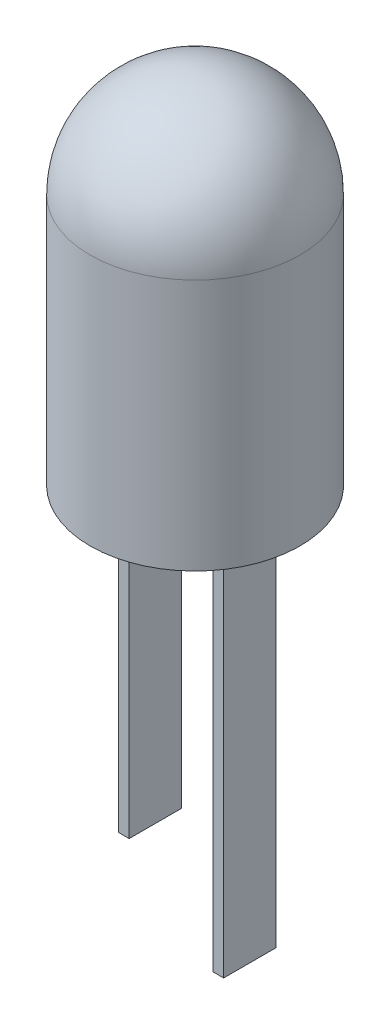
ISO-10303-21;
HEADER;
FILE_DESCRIPTION(('STEP AP214'),'2;1');
FILE_NAME('part.step','',(''),(''),'','','');
FILE_SCHEMA(('AUTOMOTIVE_DESIGN { 1 0 10303 214 1 1 1 1 }'));
ENDSEC;
DATA;
#1=APPLICATION_CONTEXT('core data for automotive mechanical design processes');
#2=APPLICATION_PROTOCOL_DEFINITION('international standard','automotive_design',2000,#1);
#3=PRODUCT_CONTEXT('',#1,'mechanical');
#4=PRODUCT('Part','Part','',(#3));
#5=PRODUCT_RELATED_PRODUCT_CATEGORY('part','',(#4));
#6=PRODUCT_DEFINITION_FORMATION('','',#4);
#7=PRODUCT_DEFINITION_CONTEXT('part definition',#1,'design');
#8=PRODUCT_DEFINITION('design','',#6,#7);
#9=PRODUCT_DEFINITION_SHAPE('','',#8);
#10=(LENGTH_UNIT() NAMED_UNIT(*) SI_UNIT(.MILLI.,.METRE.));
#11=(NAMED_UNIT(*) PLANE_ANGLE_UNIT() SI_UNIT($,.RADIAN.));
#12=(NAMED_UNIT(*) SI_UNIT($,.STERADIAN.) SOLID_ANGLE_UNIT());
#13=UNCERTAINTY_MEASURE_WITH_UNIT(LENGTH_MEASURE(1.E-05),#10,'distance_accuracy_value','');
#14=(GEOMETRIC_REPRESENTATION_CONTEXT(3) GLOBAL_UNCERTAINTY_ASSIGNED_CONTEXT((#13)) GLOBAL_UNIT_ASSIGNED_CONTEXT((#10,
#11,#12)) REPRESENTATION_CONTEXT('',''));
#15=CARTESIAN_POINT('',(0.,0.,0.));
#16=DIRECTION('',(0.,0.,1.));
#17=DIRECTION('',(1.,0.,0.));
#18=AXIS2_PLACEMENT_3D('',#15,#16,#17);
#19=CARTESIAN_POINT('',(0.,24.,0.));
#20=DIRECTION('',(0.,-1.,0.));
#21=DIRECTION('',(0.,0.,-1.));
#22=AXIS2_PLACEMENT_3D('',#19,#20,#21);
#23=CYLINDRICAL_SURFACE('',#22,9.99999999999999);
#24=CARTESIAN_POINT('',(0.,24.,0.));
#25=DIRECTION('',(0.,1.,0.));
#26=DIRECTION('',(0.,0.,1.));
#27=AXIS2_PLACEMENT_3D('',#24,#25,#26);
#28=CIRCLE('',#27,9.99999999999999);
#29=CARTESIAN_POINT('',(0.,24.,9.99999999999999));
#30=VERTEX_POINT('',#29);
#31=EDGE_CURVE('E11',#30,#30,#28,.T.);
#32=ORIENTED_EDGE('',*,*,#31,.F.);
#33=EDGE_LOOP('',(#32));
#34=FACE_BOUND('',#33,.T.);
#35=CARTESIAN_POINT('',(0.,0.,0.));
#36=DIRECTION('',(0.,1.,0.));
#37=DIRECTION('',(0.,0.,1.));
#38=AXIS2_PLACEMENT_3D('',#35,#36,#37);
#39=CIRCLE('',#38,9.99999999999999);
#40=CARTESIAN_POINT('',(0.,0.,9.99999999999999));
#41=VERTEX_POINT('',#40);
#42=EDGE_CURVE('E43',#41,#41,#39,.T.);
#43=ORIENTED_EDGE('',*,*,#42,.T.);
#44=EDGE_LOOP('',(#43));
#45=FACE_BOUND('',#44,.T.);
#46=ADVANCED_FACE('F35',(#34,#45),#23,.T.);
#47=CARTESIAN_POINT('',(0.,24.,0.));
#48=DIRECTION('',(0.,0.,1.));
#49=DIRECTION('',(1.,0.,0.));
#50=AXIS2_PLACEMENT_3D('',#47,#48,#49);
#51=SPHERICAL_SURFACE('',#50,9.99999999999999);
#52=CARTESIAN_POINT('',(0.,24.,0.));
#53=DIRECTION('',(0.,1.,0.));
#54=DIRECTION('',(0.,0.,1.));
#55=AXIS2_PLACEMENT_3D('',#52,#53,#54);
#56=SPHERICAL_SURFACE('',#55,9.99999999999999);
#57=ORIENTED_EDGE('',*,*,#31,.T.);
#58=EDGE_LOOP('',(#57));
#59=FACE_BOUND('',#58,.T.);
#60=ADVANCED_FACE('F37',(#59),#56,.T.);
#61=CARTESIAN_POINT('',(0.,0.,0.));
#62=DIRECTION('',(0.,1.,0.));
#63=DIRECTION('',(0.,0.,1.));
#64=AXIS2_PLACEMENT_3D('',#61,#62,#63);
#65=PLANE('',#64);
#66=DIRECTION('',(1.,0.,0.));
#67=VECTOR('',#66,1.);
#68=CARTESIAN_POINT('',(0.,0.,-2.72300379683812));
#69=LINE('',#68,#67);
#70=CARTESIAN_POINT('',(4.,0.,-2.72300379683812));
#71=VERTEX_POINT('',#70);
#72=CARTESIAN_POINT('',(5.,0.,-2.72300379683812));
#73=VERTEX_POINT('',#72);
#74=EDGE_CURVE('E136',#71,#73,#69,.T.);
#75=ORIENTED_EDGE('',*,*,#74,.F.);
#76=DIRECTION('',(0.,0.,1.));
#77=VECTOR('',#76,1.);
#78=CARTESIAN_POINT('',(4.,0.,-22.1414213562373));
#79=LINE('',#78,#77);
#80=CARTESIAN_POINT('',(4.,0.,2.27699620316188));
#81=VERTEX_POINT('',#80);
#82=EDGE_CURVE('E111',#71,#81,#79,.T.);
#83=ORIENTED_EDGE('',*,*,#82,.T.);
#84=DIRECTION('',(1.,0.,0.));
#85=VECTOR('',#84,1.);
#86=CARTESIAN_POINT('',(0.,0.,2.27699620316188));
#87=LINE('',#86,#85);
#88=CARTESIAN_POINT('',(5.,0.,2.27699620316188));
#89=VERTEX_POINT('',#88);
#90=EDGE_CURVE('E127',#81,#89,#87,.T.);
#91=ORIENTED_EDGE('',*,*,#90,.T.);
#92=DIRECTION('',(0.,0.,1.));
#93=VECTOR('',#92,1.);
#94=CARTESIAN_POINT('',(5.,0.,-22.1414213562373));
#95=LINE('',#94,#93);
#96=EDGE_CURVE('E50',#73,#89,#95,.T.);
#97=ORIENTED_EDGE('',*,*,#96,.F.);
#98=EDGE_LOOP('',(#75,#83,#91,#97));
#99=FACE_BOUND('',#98,.T.);
#100=DIRECTION('',(0.,0.,-1.));
#101=VECTOR('',#100,1.);
#102=CARTESIAN_POINT('',(-5.,0.,2.27699620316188));
#103=LINE('',#102,#101);
#104=CARTESIAN_POINT('',(-5.,0.,2.27699620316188));
#105=VERTEX_POINT('',#104);
#106=CARTESIAN_POINT('',(-5.,0.,-2.72300379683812));
#107=VERTEX_POINT('',#106);
#108=EDGE_CURVE('E147',#105,#107,#103,.T.);
#109=ORIENTED_EDGE('',*,*,#108,.F.);
#110=DIRECTION('',(1.,0.,0.));
#111=VECTOR('',#110,1.);
#112=CARTESIAN_POINT('',(-5.,0.,2.27699620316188));
#113=LINE('',#112,#111);
#114=CARTESIAN_POINT('',(-4.,0.,2.27699620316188));
#115=VERTEX_POINT('',#114);
#116=EDGE_CURVE('E114',#105,#115,#113,.T.);
#117=ORIENTED_EDGE('',*,*,#116,.T.);
#118=DIRECTION('',(0.,0.,-1.));
#119=VECTOR('',#118,1.);
#120=CARTESIAN_POINT('',(-4.,0.,2.27699620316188));
#121=LINE('',#120,#119);
#122=CARTESIAN_POINT('',(-4.,0.,-2.72300379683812));
#123=VERTEX_POINT('',#122);
#124=EDGE_CURVE('E157',#115,#123,#121,.T.);
#125=ORIENTED_EDGE('',*,*,#124,.T.);
#126=DIRECTION('',(1.,0.,0.));
#127=VECTOR('',#126,1.);
#128=CARTESIAN_POINT('',(-5.,0.,-2.72300379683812));
#129=LINE('',#128,#127);
#130=EDGE_CURVE('E58',#107,#123,#129,.T.);
#131=ORIENTED_EDGE('',*,*,#130,.F.);
#132=EDGE_LOOP('',(#109,#117,#125,#131));
#133=FACE_BOUND('',#132,.T.);
#134=ORIENTED_EDGE('',*,*,#42,.F.);
#135=EDGE_LOOP('',(#134));
#136=FACE_BOUND('',#135,.T.);
#137=ADVANCED_FACE('F172',(#99,#133,#136),#65,.F.);
#138=CARTESIAN_POINT('',(-5.,-30.,2.27699620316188));
#139=DIRECTION('',(0.,0.,1.));
#140=DIRECTION('',(1.,0.,0.));
#141=AXIS2_PLACEMENT_3D('',#138,#139,#140);
#142=PLANE('',#141);
#143=ORIENTED_EDGE('',*,*,#116,.F.);
#144=DIRECTION('',(0.,1.,0.));
#145=VECTOR('',#144,1.);
#146=CARTESIAN_POINT('',(-5.,-30.,2.27699620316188));
#147=LINE('',#146,#145);
#148=CARTESIAN_POINT('',(-5.,-30.,2.27699620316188));
#149=VERTEX_POINT('',#148);
#150=EDGE_CURVE('E162',#149,#105,#147,.T.);
#151=ORIENTED_EDGE('',*,*,#150,.F.);
#152=DIRECTION('',(1.,0.,0.));
#153=VECTOR('',#152,1.);
#154=CARTESIAN_POINT('',(-5.,-30.,2.27699620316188));
#155=LINE('',#154,#153);
#156=CARTESIAN_POINT('',(-4.,-30.,2.27699620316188));
#157=VERTEX_POINT('',#156);
#158=EDGE_CURVE('E143',#149,#157,#155,.T.);
#159=ORIENTED_EDGE('',*,*,#158,.T.);
#160=DIRECTION('',(0.,1.,0.));
#161=VECTOR('',#160,1.);
#162=CARTESIAN_POINT('',(-4.,-30.,2.27699620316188));
#163=LINE('',#162,#161);
#164=EDGE_CURVE('E154',#157,#115,#163,.T.);
#165=ORIENTED_EDGE('',*,*,#164,.T.);
#166=EDGE_LOOP('',(#143,#151,#159,#165));
#167=FACE_BOUND('',#166,.T.);
#168=ADVANCED_FACE('F174',(#167),#142,.T.);
#169=CARTESIAN_POINT('',(-5.,-30.,2.27699620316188));
#170=DIRECTION('',(1.,0.,0.));
#171=DIRECTION('',(0.,0.,-1.));
#172=AXIS2_PLACEMENT_3D('',#169,#170,#171);
#173=PLANE('',#172);
#174=ORIENTED_EDGE('',*,*,#108,.T.);
#175=DIRECTION('',(0.,1.,0.));
#176=VECTOR('',#175,1.);
#177=CARTESIAN_POINT('',(-5.,-30.,-2.72300379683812));
#178=LINE('',#177,#176);
#179=CARTESIAN_POINT('',(-5.,-30.,-2.72300379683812));
#180=VERTEX_POINT('',#179);
#181=EDGE_CURVE('E164',#180,#107,#178,.T.);
#182=ORIENTED_EDGE('',*,*,#181,.F.);
#183=DIRECTION('',(0.,0.,-1.));
#184=VECTOR('',#183,1.);
#185=CARTESIAN_POINT('',(-5.,-30.,2.27699620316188));
#186=LINE('',#185,#184);
#187=EDGE_CURVE('E152',#149,#180,#186,.T.);
#188=ORIENTED_EDGE('',*,*,#187,.F.);
#189=ORIENTED_EDGE('',*,*,#150,.T.);
#190=EDGE_LOOP('',(#174,#182,#188,#189));
#191=FACE_BOUND('',#190,.T.);
#192=ADVANCED_FACE('F181',(#191),#173,.F.);
#193=CARTESIAN_POINT('',(-5.,-30.,-2.72300379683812));
#194=DIRECTION('',(0.,0.,1.));
#195=DIRECTION('',(1.,0.,0.));
#196=AXIS2_PLACEMENT_3D('',#193,#194,#195);
#197=PLANE('',#196);
#198=ORIENTED_EDGE('',*,*,#130,.T.);
#199=DIRECTION('',(0.,1.,0.));
#200=VECTOR('',#199,1.);
#201=CARTESIAN_POINT('',(-4.,-30.,-2.72300379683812));
#202=LINE('',#201,#200);
#203=CARTESIAN_POINT('',(-4.,-30.,-2.72300379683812));
#204=VERTEX_POINT('',#203);
#205=EDGE_CURVE('E166',#204,#123,#202,.T.);
#206=ORIENTED_EDGE('',*,*,#205,.F.);
#207=DIRECTION('',(1.,0.,0.));
#208=VECTOR('',#207,1.);
#209=CARTESIAN_POINT('',(-5.,-30.,-2.72300379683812));
#210=LINE('',#209,#208);
#211=EDGE_CURVE('E150',#180,#204,#210,.T.);
#212=ORIENTED_EDGE('',*,*,#211,.F.);
#213=ORIENTED_EDGE('',*,*,#181,.T.);
#214=EDGE_LOOP('',(#198,#206,#212,#213));
#215=FACE_BOUND('',#214,.T.);
#216=ADVANCED_FACE('F211',(#215),#197,.F.);
#217=CARTESIAN_POINT('',(-4.,-30.,2.27699620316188));
#218=DIRECTION('',(1.,0.,0.));
#219=DIRECTION('',(0.,0.,-1.));
#220=AXIS2_PLACEMENT_3D('',#217,#218,#219);
#221=PLANE('',#220);
#222=ORIENTED_EDGE('',*,*,#124,.F.);
#223=ORIENTED_EDGE('',*,*,#164,.F.);
#224=DIRECTION('',(0.,0.,-1.));
#225=VECTOR('',#224,1.);
#226=CARTESIAN_POINT('',(-4.,-30.,2.27699620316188));
#227=LINE('',#226,#225);
#228=EDGE_CURVE('E146',#157,#204,#227,.T.);
#229=ORIENTED_EDGE('',*,*,#228,.T.);
#230=ORIENTED_EDGE('',*,*,#205,.T.);
#231=EDGE_LOOP('',(#222,#223,#229,#230));
#232=FACE_BOUND('',#231,.T.);
#233=ADVANCED_FACE('F221',(#232),#221,.T.);
#234=CARTESIAN_POINT('',(-4.,-30.,2.27699620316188));
#235=DIRECTION('',(0.,1.,0.));
#236=DIRECTION('',(0.,0.,1.));
#237=AXIS2_PLACEMENT_3D('',#234,#235,#236);
#238=PLANE('',#237);
#239=ORIENTED_EDGE('',*,*,#158,.F.);
#240=ORIENTED_EDGE('',*,*,#187,.T.);
#241=ORIENTED_EDGE('',*,*,#211,.T.);
#242=ORIENTED_EDGE('',*,*,#228,.F.);
#243=EDGE_LOOP('',(#239,#240,#241,#242));
#244=FACE_BOUND('',#243,.T.);
#245=ADVANCED_FACE('F230',(#244),#238,.F.);
#246=CARTESIAN_POINT('',(4.,-37.,-22.1414213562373));
#247=DIRECTION('',(-1.,0.,0.));
#248=DIRECTION('',(0.,0.,1.));
#249=AXIS2_PLACEMENT_3D('',#246,#247,#248);
#250=PLANE('',#249);
#251=ORIENTED_EDGE('',*,*,#82,.F.);
#252=DIRECTION('',(0.,1.,0.));
#253=VECTOR('',#252,1.);
#254=CARTESIAN_POINT('',(4.,-37.,-2.72300379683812));
#255=LINE('',#254,#253);
#256=CARTESIAN_POINT('',(4.,-37.,-2.72300379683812));
#257=VERTEX_POINT('',#256);
#258=EDGE_CURVE('E104',#257,#71,#255,.T.);
#259=ORIENTED_EDGE('',*,*,#258,.F.);
#260=DIRECTION('',(0.,0.,1.));
#261=VECTOR('',#260,1.);
#262=CARTESIAN_POINT('',(4.,-37.,-22.1414213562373));
#263=LINE('',#262,#261);
#264=CARTESIAN_POINT('',(4.,-37.,2.27699620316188));
#265=VERTEX_POINT('',#264);
#266=EDGE_CURVE('E108',#257,#265,#263,.T.);
#267=ORIENTED_EDGE('',*,*,#266,.T.);
#268=DIRECTION('',(0.,1.,0.));
#269=VECTOR('',#268,1.);
#270=CARTESIAN_POINT('',(4.,-37.,2.27699620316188));
#271=LINE('',#270,#269);
#272=EDGE_CURVE('E134',#265,#81,#271,.T.);
#273=ORIENTED_EDGE('',*,*,#272,.T.);
#274=EDGE_LOOP('',(#251,#259,#267,#273));
#275=FACE_BOUND('',#274,.T.);
#276=ADVANCED_FACE('F106',(#275),#250,.T.);
#277=CARTESIAN_POINT('',(0.,-37.,-2.72300379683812));
#278=DIRECTION('',(0.,0.,1.));
#279=DIRECTION('',(1.,0.,0.));
#280=AXIS2_PLACEMENT_3D('',#277,#278,#279);
#281=PLANE('',#280);
#282=ORIENTED_EDGE('',*,*,#74,.T.);
#283=DIRECTION('',(0.,1.,0.));
#284=VECTOR('',#283,1.);
#285=CARTESIAN_POINT('',(5.,-37.,-2.72300379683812));
#286=LINE('',#285,#284);
#287=CARTESIAN_POINT('',(5.,-37.,-2.72300379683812));
#288=VERTEX_POINT('',#287);
#289=EDGE_CURVE('E115',#288,#73,#286,.T.);
#290=ORIENTED_EDGE('',*,*,#289,.F.);
#291=DIRECTION('',(1.,0.,0.));
#292=VECTOR('',#291,1.);
#293=CARTESIAN_POINT('',(0.,-37.,-2.72300379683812));
#294=LINE('',#293,#292);
#295=EDGE_CURVE('E118',#257,#288,#294,.T.);
#296=ORIENTED_EDGE('',*,*,#295,.F.);
#297=ORIENTED_EDGE('',*,*,#258,.T.);
#298=EDGE_LOOP('',(#282,#290,#296,#297));
#299=FACE_BOUND('',#298,.T.);
#300=ADVANCED_FACE('F119',(#299),#281,.F.);
#301=CARTESIAN_POINT('',(5.,-37.,-22.1414213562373));
#302=DIRECTION('',(-1.,0.,0.));
#303=DIRECTION('',(0.,0.,1.));
#304=AXIS2_PLACEMENT_3D('',#301,#302,#303);
#305=PLANE('',#304);
#306=ORIENTED_EDGE('',*,*,#96,.T.);
#307=DIRECTION('',(0.,1.,0.));
#308=VECTOR('',#307,1.);
#309=CARTESIAN_POINT('',(5.,-37.,2.27699620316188));
#310=LINE('',#309,#308);
#311=CARTESIAN_POINT('',(5.,-37.,2.27699620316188));
#312=VERTEX_POINT('',#311);
#313=EDGE_CURVE('E140',#312,#89,#310,.T.);
#314=ORIENTED_EDGE('',*,*,#313,.F.);
#315=DIRECTION('',(0.,0.,1.));
#316=VECTOR('',#315,1.);
#317=CARTESIAN_POINT('',(5.,-37.,-22.1414213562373));
#318=LINE('',#317,#316);
#319=EDGE_CURVE('E122',#288,#312,#318,.T.);
#320=ORIENTED_EDGE('',*,*,#319,.F.);
#321=ORIENTED_EDGE('',*,*,#289,.T.);
#322=EDGE_LOOP('',(#306,#314,#320,#321));
#323=FACE_BOUND('',#322,.T.);
#324=ADVANCED_FACE('F262',(#323),#305,.F.);
#325=CARTESIAN_POINT('',(0.,-37.,2.27699620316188));
#326=DIRECTION('',(0.,0.,1.));
#327=DIRECTION('',(1.,0.,0.));
#328=AXIS2_PLACEMENT_3D('',#325,#326,#327);
#329=PLANE('',#328);
#330=ORIENTED_EDGE('',*,*,#90,.F.);
#331=ORIENTED_EDGE('',*,*,#272,.F.);
#332=DIRECTION('',(1.,0.,0.));
#333=VECTOR('',#332,1.);
#334=CARTESIAN_POINT('',(0.,-37.,2.27699620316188));
#335=LINE('',#334,#333);
#336=EDGE_CURVE('E126',#265,#312,#335,.T.);
#337=ORIENTED_EDGE('',*,*,#336,.T.);
#338=ORIENTED_EDGE('',*,*,#313,.T.);
#339=EDGE_LOOP('',(#330,#331,#337,#338));
#340=FACE_BOUND('',#339,.T.);
#341=ADVANCED_FACE('F273',(#340),#329,.T.);
#342=CARTESIAN_POINT('',(0.,-37.,-22.1414213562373));
#343=DIRECTION('',(0.,-1.,0.));
#344=DIRECTION('',(0.,0.,-1.));
#345=AXIS2_PLACEMENT_3D('',#342,#343,#344);
#346=PLANE('',#345);
#347=ORIENTED_EDGE('',*,*,#266,.F.);
#348=ORIENTED_EDGE('',*,*,#295,.T.);
#349=ORIENTED_EDGE('',*,*,#319,.T.);
#350=ORIENTED_EDGE('',*,*,#336,.F.);
#351=EDGE_LOOP('',(#347,#348,#349,#350));
#352=FACE_BOUND('',#351,.T.);
#353=ADVANCED_FACE('F124',(#352),#346,.T.);
#354=CLOSED_SHELL('',(#46,#60,#137,#168,#192,#216,#233,#245,#276,#300,#324,#341,#353));
#355=MANIFOLD_SOLID_BREP('B2',#354);
#356=ADVANCED_BREP_SHAPE_REPRESENTATION('',(#18,#355),#14);
#357=SHAPE_DEFINITION_REPRESENTATION(#9,#356);
ENDSEC;
END-ISO-10303-21;
